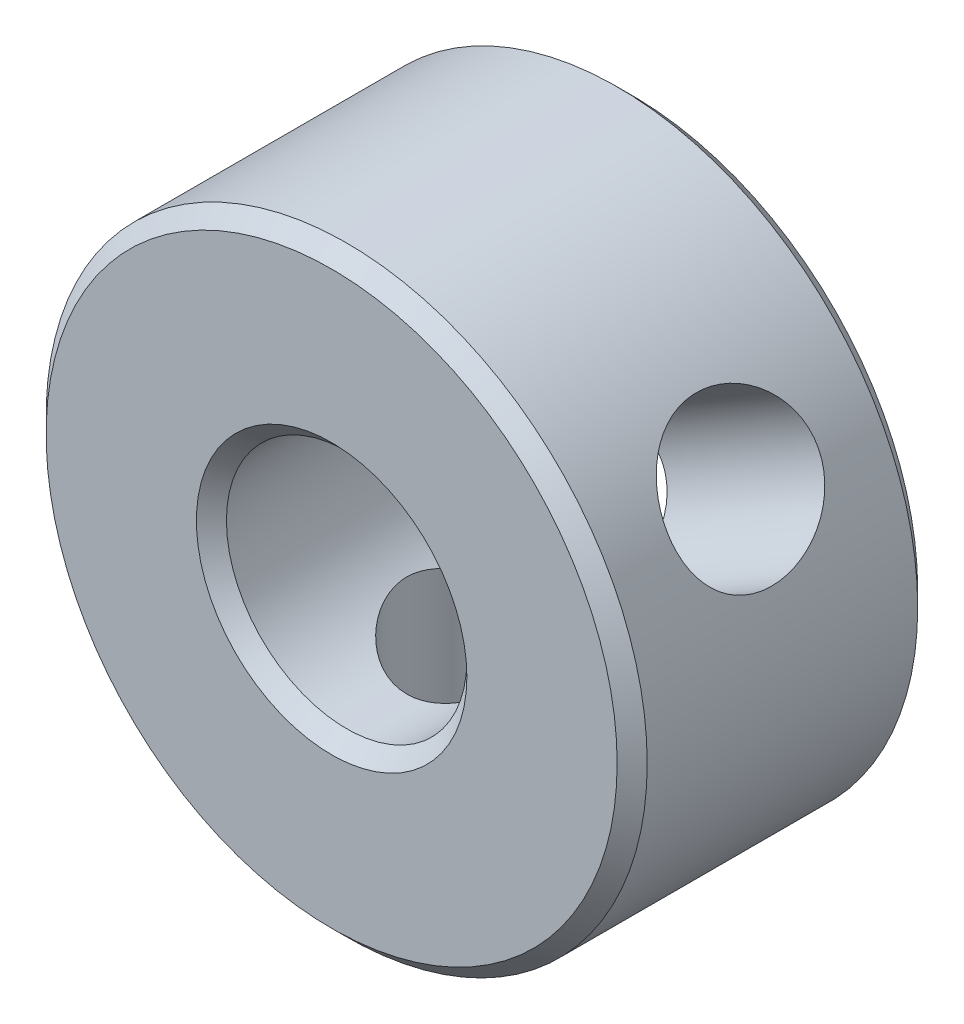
ISO-10303-21;
HEADER;
FILE_DESCRIPTION(('STEP AP214'),'2;1');
FILE_NAME('part.step','',(''),(''),'','','');
FILE_SCHEMA(('AUTOMOTIVE_DESIGN { 1 0 10303 214 1 1 1 1 }'));
ENDSEC;
DATA;
#1=APPLICATION_CONTEXT('core data for automotive mechanical design processes');
#2=APPLICATION_PROTOCOL_DEFINITION('international standard','automotive_design',2000,#1);
#3=PRODUCT_CONTEXT('',#1,'mechanical');
#4=PRODUCT('Part','Part','',(#3));
#5=PRODUCT_RELATED_PRODUCT_CATEGORY('part','',(#4));
#6=PRODUCT_DEFINITION_FORMATION('','',#4);
#7=PRODUCT_DEFINITION_CONTEXT('part definition',#1,'design');
#8=PRODUCT_DEFINITION('design','',#6,#7);
#9=PRODUCT_DEFINITION_SHAPE('','',#8);
#10=(LENGTH_UNIT() NAMED_UNIT(*) SI_UNIT(.MILLI.,.METRE.));
#11=(NAMED_UNIT(*) PLANE_ANGLE_UNIT() SI_UNIT($,.RADIAN.));
#12=(NAMED_UNIT(*) SI_UNIT($,.STERADIAN.) SOLID_ANGLE_UNIT());
#13=UNCERTAINTY_MEASURE_WITH_UNIT(LENGTH_MEASURE(1.E-05),#10,'distance_accuracy_value','');
#14=(GEOMETRIC_REPRESENTATION_CONTEXT(3) GLOBAL_UNCERTAINTY_ASSIGNED_CONTEXT((#13)) GLOBAL_UNIT_ASSIGNED_CONTEXT((#10,
#11,#12)) REPRESENTATION_CONTEXT('',''));
#15=CARTESIAN_POINT('',(0.,0.,0.));
#16=DIRECTION('',(0.,0.,1.));
#17=DIRECTION('',(1.,0.,0.));
#18=AXIS2_PLACEMENT_3D('',#15,#16,#17);
#19=CARTESIAN_POINT('',(0.,0.,-10.));
#20=DIRECTION('',(0.,0.,1.));
#21=DIRECTION('',(1.,0.,0.));
#22=AXIS2_PLACEMENT_3D('',#19,#20,#21);
#23=CYLINDRICAL_SURFACE('',#22,10.);
#24=CARTESIAN_POINT('',(9.6352549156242,2.67616567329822,-5.));
#25=CARTESIAN_POINT('',(9.63525523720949,2.67617038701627,-5.13805075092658));
#26=CARTESIAN_POINT('',(9.63210285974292,2.68759458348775,-5.27614489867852));
#27=CARTESIAN_POINT('',(9.61937602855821,2.73278922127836,-5.54836757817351));
#28=CARTESIAN_POINT('',(9.60979783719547,2.76657266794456,-5.68249375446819));
#29=CARTESIAN_POINT('',(9.58391006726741,2.85495532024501,-5.94280353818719));
#30=CARTESIAN_POINT('',(9.56760917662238,2.90952765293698,-6.06899715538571));
#31=CARTESIAN_POINT('',(9.5278131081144,3.03730745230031,-6.31031085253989));
#32=CARTESIAN_POINT('',(9.5043176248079,3.11051571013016,-6.42543046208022));
#33=CARTESIAN_POINT('',(9.44907629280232,3.27453410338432,-6.64386164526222));
#34=CARTESIAN_POINT('',(9.4171759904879,3.36566467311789,-6.74689360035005));
#35=CARTESIAN_POINT('',(9.34490436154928,3.56140836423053,-6.93576139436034));
#36=CARTESIAN_POINT('',(9.30453224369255,3.66602274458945,-7.02159562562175));
#37=CARTESIAN_POINT('',(9.21449269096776,3.88683880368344,-7.17477546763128));
#38=CARTESIAN_POINT('',(9.16470341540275,4.00318179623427,-7.24184638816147));
#39=CARTESIAN_POINT('',(9.05647555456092,4.24234044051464,-7.35380964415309));
#40=CARTESIAN_POINT('',(8.9980382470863,4.36515513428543,-7.39870525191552));
#41=CARTESIAN_POINT('',(8.87468040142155,4.61069782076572,-7.46414783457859));
#42=CARTESIAN_POINT('',(8.80991518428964,4.73337716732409,-7.48516964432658));
#43=CARTESIAN_POINT('',(8.67447899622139,4.97723353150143,-7.50375837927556));
#44=CARTESIAN_POINT('',(8.60380889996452,5.09841076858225,-7.5013287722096));
#45=CARTESIAN_POINT('',(8.46033146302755,5.33303795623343,-7.47342514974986));
#46=CARTESIAN_POINT('',(8.38760634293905,5.44659970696,-7.44846367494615));
#47=CARTESIAN_POINT('',(8.24102110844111,5.66594946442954,-7.3770287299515));
#48=CARTESIAN_POINT('',(8.16716093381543,5.77173705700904,-7.33055411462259));
#49=CARTESIAN_POINT('',(8.02036378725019,5.9740726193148,-7.21699742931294));
#50=CARTESIAN_POINT('',(7.94744118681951,6.07052846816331,-7.14973295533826));
#51=CARTESIAN_POINT('',(7.80609517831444,6.25124461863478,-6.99664432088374));
#52=CARTESIAN_POINT('',(7.73767255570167,6.33550279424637,-6.91081693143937));
#53=CARTESIAN_POINT('',(7.60646202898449,6.49249557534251,-6.72029125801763));
#54=CARTESIAN_POINT('',(7.54387674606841,6.56485658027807,-6.61514510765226));
#55=CARTESIAN_POINT('',(7.42950428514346,6.69402197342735,-6.39040002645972));
#56=CARTESIAN_POINT('',(7.37771761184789,6.75082563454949,-6.2708004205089));
#57=CARTESIAN_POINT('',(7.28744965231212,6.84817688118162,-6.01970996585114));
#58=CARTESIAN_POINT('',(7.24903410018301,6.88864430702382,-5.8881642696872));
#59=CARTESIAN_POINT('',(7.1881168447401,6.9521892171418,-5.61741453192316));
#60=CARTESIAN_POINT('',(7.16561173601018,6.97527042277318,-5.4782121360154));
#61=CARTESIAN_POINT('',(7.13828856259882,7.00322865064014,-5.20004049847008));
#62=CARTESIAN_POINT('',(7.1330190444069,7.00857038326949,-5.06116220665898));
#63=CARTESIAN_POINT('',(7.13922190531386,7.00225180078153,-4.78417806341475));
#64=CARTESIAN_POINT('',(7.15069274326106,6.99059305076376,-4.64607214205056));
#65=CARTESIAN_POINT('',(7.18934405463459,6.95083246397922,-4.37688573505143));
#66=CARTESIAN_POINT('',(7.21626442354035,6.92300278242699,-4.2457272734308));
#67=CARTESIAN_POINT('',(7.28408845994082,6.85160306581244,-3.99156854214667));
#68=CARTESIAN_POINT('',(7.32499378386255,6.80803116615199,-3.86856924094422));
#69=CARTESIAN_POINT('',(7.41957761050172,6.70483734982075,-3.6315587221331));
#70=CARTESIAN_POINT('',(7.47349094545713,6.64491734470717,-3.51777115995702));
#71=CARTESIAN_POINT('',(7.59098627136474,6.51036775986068,-3.30481163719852));
#72=CARTESIAN_POINT('',(7.65456985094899,6.43573576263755,-3.20564208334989));
#73=CARTESIAN_POINT('',(7.79021214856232,6.27090481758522,-3.02218895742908));
#74=CARTESIAN_POINT('',(7.86244311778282,6.1803630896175,-2.9383399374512));
#75=CARTESIAN_POINT('',(8.01084582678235,5.98675234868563,-2.79106413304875));
#76=CARTESIAN_POINT('',(8.0870173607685,5.88368398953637,-2.72763628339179));
#77=CARTESIAN_POINT('',(8.23956671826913,5.66805412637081,-2.62355396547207));
#78=CARTESIAN_POINT('',(8.31593892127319,5.55556787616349,-2.58273571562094));
#79=CARTESIAN_POINT('',(8.46649332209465,5.32330927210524,-2.52453966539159));
#80=CARTESIAN_POINT('',(8.54067593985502,5.20353832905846,-2.50715734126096));
#81=CARTESIAN_POINT('',(8.68234823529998,4.96344019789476,-2.49658102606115));
#82=CARTESIAN_POINT('',(8.74996464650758,4.84321561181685,-2.50274572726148));
#83=CARTESIAN_POINT('',(8.87886382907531,4.60265155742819,-2.53761956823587));
#84=CARTESIAN_POINT('',(8.94014678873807,4.48231209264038,-2.56632803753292));
#85=CARTESIAN_POINT('',(9.05484155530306,4.24582601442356,-2.64513054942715));
#86=CARTESIAN_POINT('',(9.10829395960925,4.12966031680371,-2.69510863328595));
#87=CARTESIAN_POINT('',(9.20712587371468,3.90435464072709,-2.81492644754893));
#88=CARTESIAN_POINT('',(9.25250436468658,3.79521555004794,-2.88476868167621));
#89=CARTESIAN_POINT('',(9.33607529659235,3.58480572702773,-3.04428808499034));
#90=CARTESIAN_POINT('',(9.37406953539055,3.48378613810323,-3.13440035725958));
#91=CARTESIAN_POINT('',(9.4417659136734,3.29591417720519,-3.33105712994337));
#92=CARTESIAN_POINT('',(9.47146594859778,3.20906540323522,-3.43760579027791));
#93=CARTESIAN_POINT('',(9.52353066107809,3.05113481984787,-3.66650353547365));
#94=CARTESIAN_POINT('',(9.54574815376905,2.98037738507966,-3.78911030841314));
#95=CARTESIAN_POINT('',(9.58262240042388,2.85960890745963,-4.04513872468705));
#96=CARTESIAN_POINT('',(9.59728465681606,2.80958277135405,-4.17855241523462));
#97=CARTESIAN_POINT('',(9.61743337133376,2.73971219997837,-4.4264425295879));
#98=CARTESIAN_POINT('',(9.62413024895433,2.71595058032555,-4.53973291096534));
#99=CARTESIAN_POINT('',(9.63304069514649,2.68417601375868,-4.76867217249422));
#100=CARTESIAN_POINT('',(9.63525464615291,2.67616172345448,-4.88432085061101));
#101=CARTESIAN_POINT('',(9.6352549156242,2.67616567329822,-5.));
#102=B_SPLINE_CURVE_WITH_KNOTS('',3,(#24,#25,#26,#27,#28,#29,#30,#31,#32,#33,#34,#35,#36,#37,
#38,#39,#40,#41,#42,#43,#44,#45,#46,#47,#48,#49,#50,#51,#52,#53,#54,#55,#56,#57,#58,#59,#60,#61,
#62,#63,#64,#65,#66,#67,#68,#69,#70,#71,#72,#73,#74,#75,#76,#77,#78,#79,#80,#81,#82,#83,#84,#85,
#86,#87,#88,#89,#90,#91,#92,#93,#94,#95,#96,#97,#98,#99,#100,#101),.UNSPECIFIED.,.T.,.F.,(4,2,2,
2,2,2,2,2,2,2,2,2,2,2,2,2,2,2,2,2,2,2,2,2,2,2,2,2,2,2,2,2,2,2,2,2,2,2,4),(0.,0.413727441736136,
0.827695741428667,1.24113072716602,1.65458326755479,2.07623954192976,2.49793521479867,
2.9255149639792,3.35303159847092,3.77188750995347,4.19068148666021,4.60018262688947,
5.00970556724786,5.42292874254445,5.83622385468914,6.26070466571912,6.68520531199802,
7.11176432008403,7.53823200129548,7.95343574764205,8.36860127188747,8.77697405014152,
9.18539521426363,9.60182845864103,10.0183301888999,10.4452533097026,10.872154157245,
11.2959207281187,11.7196054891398,12.131834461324,12.5440511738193,12.9540487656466,
13.3640980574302,13.7839709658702,14.2039503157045,14.6317647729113,15.0592672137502,
15.4059782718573,15.7526597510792),.UNSPECIFIED.);
#103=CARTESIAN_POINT('',(9.6352549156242,2.67616567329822,-5.));
#104=VERTEX_POINT('',#103);
#105=EDGE_CURVE('E63',#104,#104,#102,.T.);
#106=ORIENTED_EDGE('',*,*,#105,.F.);
#107=EDGE_LOOP('',(#106));
#108=FACE_BOUND('',#107,.T.);
#109=CARTESIAN_POINT('',(0.,-10.,-2.5));
#110=CARTESIAN_POINT('',(-0.138126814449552,-9.99999766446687,-2.50000387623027));
#111=CARTESIAN_POINT('',(-0.276296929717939,-9.99710963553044,-2.51148591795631));
#112=CARTESIAN_POINT('',(-0.548677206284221,-9.98586856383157,-2.55704191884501));
#113=CARTESIAN_POINT('',(-0.682885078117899,-9.97751242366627,-2.59112868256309));
#114=CARTESIAN_POINT('',(-0.943368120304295,-9.9562604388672,-2.68073208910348));
#115=CARTESIAN_POINT('',(-1.06965260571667,-9.94337004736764,-2.73622299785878));
#116=CARTESIAN_POINT('',(-1.31112021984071,-9.91442239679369,-2.86696898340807));
#117=CARTESIAN_POINT('',(-1.42630297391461,-9.89836503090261,-2.94222472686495));
#118=CARTESIAN_POINT('',(-1.64466987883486,-9.86445689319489,-3.1120013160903));
#119=CARTESIAN_POINT('',(-1.74759281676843,-9.84657845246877,-3.20685262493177));
#120=CARTESIAN_POINT('',(-1.93624821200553,-9.8112270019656,-3.41242034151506));
#121=CARTESIAN_POINT('',(-2.02197872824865,-9.79375403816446,-3.5231385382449));
#122=CARTESIAN_POINT('',(-2.17504423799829,-9.76091292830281,-3.75932537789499));
#123=CARTESIAN_POINT('',(-2.2420870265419,-9.74557990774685,-3.88498871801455));
#124=CARTESIAN_POINT('',(-2.35399484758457,-9.71915824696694,-4.14624735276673));
#125=CARTESIAN_POINT('',(-2.39886342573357,-9.70806892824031,-4.28184105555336));
#126=CARTESIAN_POINT('',(-2.46425806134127,-9.69167461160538,-4.55623916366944));
#127=CARTESIAN_POINT('',(-2.48525378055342,-9.68625818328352,-4.69492482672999));
#128=CARTESIAN_POINT('',(-2.50376962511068,-9.68148937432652,-4.97394761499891));
#129=CARTESIAN_POINT('',(-2.50129356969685,-9.68213600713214,-5.11428446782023));
#130=CARTESIAN_POINT('',(-2.47331087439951,-9.68932009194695,-5.38902634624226));
#131=CARTESIAN_POINT('',(-2.44836390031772,-9.69571438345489,-5.52349270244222));
#132=CARTESIAN_POINT('',(-2.37704031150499,-9.71344516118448,-5.7862684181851));
#133=CARTESIAN_POINT('',(-2.33066217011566,-9.72478199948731,-5.91457733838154));
#134=CARTESIAN_POINT('',(-2.21731579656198,-9.75125189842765,-6.16289669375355));
#135=CARTESIAN_POINT('',(-2.1501444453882,-9.76642212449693,-6.28281028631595));
#136=CARTESIAN_POINT('',(-1.99726046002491,-9.79882851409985,-6.50986451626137));
#137=CARTESIAN_POINT('',(-1.91154458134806,-9.81606503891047,-6.61700291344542));
#138=CARTESIAN_POINT('',(-1.72110570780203,-9.85126467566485,-6.81867269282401));
#139=CARTESIAN_POINT('',(-1.61591043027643,-9.86923449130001,-6.91275748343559));
#140=CARTESIAN_POINT('',(-1.39101986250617,-9.90343275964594,-7.08203540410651));
#141=CARTESIAN_POINT('',(-1.27132412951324,-9.91966115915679,-7.15722795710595));
#142=CARTESIAN_POINT('',(-1.02019314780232,-9.94862886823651,-7.28675097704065));
#143=CARTESIAN_POINT('',(-0.88871898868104,-9.96135600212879,-7.34100890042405));
#144=CARTESIAN_POINT('',(-0.618126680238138,-9.98179861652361,-7.42652884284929));
#145=CARTESIAN_POINT('',(-0.479009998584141,-9.98951505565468,-7.4577952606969));
#146=CARTESIAN_POINT('',(-0.200899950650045,-9.99892498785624,-7.49576260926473));
#147=CARTESIAN_POINT('',(-0.0619945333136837,-10.0007675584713,-7.50307171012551));
#148=CARTESIAN_POINT('',(0.215054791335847,-9.99864674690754,-7.49458499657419));
#149=CARTESIAN_POINT('',(0.353198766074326,-9.99468388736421,-7.47879126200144));
#150=CARTESIAN_POINT('',(0.622690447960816,-9.98149301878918,-7.42504848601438));
#151=CARTESIAN_POINT('',(0.754108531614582,-9.97234390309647,-7.38743122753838));
#152=CARTESIAN_POINT('',(1.00876215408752,-9.94981177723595,-7.2914881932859));
#153=CARTESIAN_POINT('',(1.13199686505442,-9.93642833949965,-7.23316032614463));
#154=CARTESIAN_POINT('',(1.36920522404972,-9.9065551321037,-7.09627311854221));
#155=CARTESIAN_POINT('',(1.48297573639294,-9.89001445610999,-7.01737314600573));
#156=CARTESIAN_POINT('',(1.69587768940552,-9.85574181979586,-6.84201681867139));
#157=CARTESIAN_POINT('',(1.79500659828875,-9.83800965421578,-6.74555743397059));
#158=CARTESIAN_POINT('',(1.97831761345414,-9.80281594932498,-6.53499673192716));
#159=CARTESIAN_POINT('',(2.06207311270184,-9.78537173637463,-6.42052049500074));
#160=CARTESIAN_POINT('',(2.20918459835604,-9.75321463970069,-6.17877894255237));
#161=CARTESIAN_POINT('',(2.27254149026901,-9.73850163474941,-6.05151419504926));
#162=CARTESIAN_POINT('',(2.37658570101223,-9.71363491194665,-5.78849046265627));
#163=CARTESIAN_POINT('',(2.41740732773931,-9.70345425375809,-5.65278728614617));
#164=CARTESIAN_POINT('',(2.47557609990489,-9.68877906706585,-5.37615060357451));
#165=CARTESIAN_POINT('',(2.49292837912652,-9.68428329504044,-5.23521824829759));
#166=CARTESIAN_POINT('',(2.50339765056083,-9.68158168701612,-4.95646496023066));
#167=CARTESIAN_POINT('',(2.49719649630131,-9.68319887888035,-4.81867094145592));
#168=CARTESIAN_POINT('',(2.46229546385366,-9.69213181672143,-4.54616018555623));
#169=CARTESIAN_POINT('',(2.43359603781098,-9.69944744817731,-4.41144338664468));
#170=CARTESIAN_POINT('',(2.35488553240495,-9.71885434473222,-4.14965256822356));
#171=CARTESIAN_POINT('',(2.30500234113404,-9.73091692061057,-4.02253782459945));
#172=CARTESIAN_POINT('',(2.18544152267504,-9.7584625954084,-3.77839102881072));
#173=CARTESIAN_POINT('',(2.11576115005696,-9.77394616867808,-3.66136037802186));
#174=CARTESIAN_POINT('',(1.95644624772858,-9.80709390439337,-3.43740895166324));
#175=CARTESIAN_POINT('',(1.86633860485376,-9.82480441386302,-3.33083154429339));
#176=CARTESIAN_POINT('',(1.66964895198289,-9.86013378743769,-3.13408825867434));
#177=CARTESIAN_POINT('',(1.56306303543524,-9.87775262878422,-3.04392628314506));
#178=CARTESIAN_POINT('',(1.33411264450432,-9.9112942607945,-2.88098115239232));
#179=CARTESIAN_POINT('',(1.21149737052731,-9.92718055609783,-2.80854231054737));
#180=CARTESIAN_POINT('',(0.95544343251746,-9.95508208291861,-2.68542089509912));
#181=CARTESIAN_POINT('',(0.822012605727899,-9.96710008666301,-2.63472273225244));
#182=CARTESIAN_POINT('',(0.57401708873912,-9.98413432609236,-2.56404694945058));
#183=CARTESIAN_POINT('',(0.460633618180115,-9.99004308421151,-2.54008126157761));
#184=CARTESIAN_POINT('',(0.231510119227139,-9.9979767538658,-2.5080567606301));
#185=CARTESIAN_POINT('',(0.115770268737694,-10.0000019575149,-2.49999675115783));
#186=CARTESIAN_POINT('',(0.,-10.,-2.5));
#187=B_SPLINE_CURVE_WITH_KNOTS('',3,(#109,#110,#111,#112,#113,#114,#115,#116,#117,#118,#119,
#120,#121,#122,#123,#124,#125,#126,#127,#128,#129,#130,#131,#132,#133,#134,#135,#136,#137,#138,
#139,#140,#141,#142,#143,#144,#145,#146,#147,#148,#149,#150,#151,#152,#153,#154,#155,#156,#157,
#158,#159,#160,#161,#162,#163,#164,#165,#166,#167,#168,#169,#170,#171,#172,#173,#174,#175,#176,
#177,#178,#179,#180,#181,#182,#183,#184,#185,#186),.UNSPECIFIED.,.T.,.F.,(4,2,2,2,2,2,2,2,2,2,2,
2,2,2,2,2,2,2,2,2,2,2,2,2,2,2,2,2,2,2,2,2,2,2,2,2,2,2,4),(0.,0.41395618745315,0.828147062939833,
1.24184150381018,1.65554990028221,2.07690725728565,2.4983121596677,2.92597745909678,
3.35357435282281,3.77260491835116,4.19156730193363,4.60037495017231,5.00921172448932,
5.42217546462,5.83521151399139,6.26002501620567,6.6848514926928,7.11113715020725,
7.53734122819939,7.95263848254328,8.36789835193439,8.7770045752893,9.18615212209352,
9.60255979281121,10.0190393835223,10.4457418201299,10.8724253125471,11.2965375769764,
11.7205570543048,12.1323963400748,12.5442273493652,12.9536066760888,13.3630428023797,
13.7831596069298,14.2033761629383,14.6312030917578,15.0587227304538,15.4057040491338,
15.752659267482),.UNSPECIFIED.);
#188=CARTESIAN_POINT('',(0.,-10.,-2.5));
#189=VERTEX_POINT('',#188);
#190=EDGE_CURVE('E62',#189,#189,#187,.T.);
#191=ORIENTED_EDGE('',*,*,#190,.F.);
#192=EDGE_LOOP('',(#191));
#193=FACE_BOUND('',#192,.T.);
#194=CARTESIAN_POINT('',(0.,0.,-0.5));
#195=DIRECTION('',(0.,0.,1.));
#196=DIRECTION('',(1.,0.,0.));
#197=AXIS2_PLACEMENT_3D('',#194,#195,#196);
#198=CIRCLE('',#197,10.);
#199=CARTESIAN_POINT('',(10.,0.,-0.5));
#200=VERTEX_POINT('',#199);
#201=EDGE_CURVE('E116',#200,#200,#198,.F.);
#202=ORIENTED_EDGE('',*,*,#201,.T.);
#203=EDGE_LOOP('',(#202));
#204=FACE_BOUND('',#203,.T.);
#205=CARTESIAN_POINT('',(0.,0.,-9.5));
#206=DIRECTION('',(0.,0.,1.));
#207=DIRECTION('',(1.,0.,0.));
#208=AXIS2_PLACEMENT_3D('',#205,#206,#207);
#209=CIRCLE('',#208,10.);
#210=CARTESIAN_POINT('',(10.,0.,-9.5));
#211=VERTEX_POINT('',#210);
#212=EDGE_CURVE('E118',#211,#211,#209,.T.);
#213=ORIENTED_EDGE('',*,*,#212,.T.);
#214=EDGE_LOOP('',(#213));
#215=FACE_BOUND('',#214,.T.);
#216=ADVANCED_FACE('F31',(#108,#193,#204,#215),#23,.T.);
#217=CARTESIAN_POINT('',(0.,0.,-10.));
#218=DIRECTION('',(0.,0.,1.));
#219=DIRECTION('',(1.,0.,0.));
#220=AXIS2_PLACEMENT_3D('',#217,#218,#219);
#221=PLANE('',#220);
#222=CARTESIAN_POINT('',(0.,0.,-10.));
#223=DIRECTION('',(0.,0.,1.));
#224=DIRECTION('',(1.,0.,0.));
#225=AXIS2_PLACEMENT_3D('',#222,#223,#224);
#226=CIRCLE('',#225,4.5);
#227=CARTESIAN_POINT('',(4.5,0.,-10.));
#228=VERTEX_POINT('',#227);
#229=EDGE_CURVE('E52',#228,#228,#226,.T.);
#230=ORIENTED_EDGE('',*,*,#229,.T.);
#231=EDGE_LOOP('',(#230));
#232=FACE_BOUND('',#231,.T.);
#233=CARTESIAN_POINT('',(0.,0.,-10.));
#234=DIRECTION('',(0.,0.,1.));
#235=DIRECTION('',(1.,0.,0.));
#236=AXIS2_PLACEMENT_3D('',#233,#234,#235);
#237=CIRCLE('',#236,9.5);
#238=CARTESIAN_POINT('',(9.5,0.,-10.));
#239=VERTEX_POINT('',#238);
#240=EDGE_CURVE('E55',#239,#239,#237,.F.);
#241=ORIENTED_EDGE('',*,*,#240,.T.);
#242=EDGE_LOOP('',(#241));
#243=FACE_BOUND('',#242,.T.);
#244=ADVANCED_FACE('F92',(#232,#243),#221,.F.);
#245=CARTESIAN_POINT('',(0.,0.,0.));
#246=DIRECTION('',(0.,0.,1.));
#247=DIRECTION('',(1.,0.,0.));
#248=AXIS2_PLACEMENT_3D('',#245,#246,#247);
#249=PLANE('',#248);
#250=CARTESIAN_POINT('',(0.,0.,0.));
#251=DIRECTION('',(0.,0.,1.));
#252=DIRECTION('',(1.,0.,0.));
#253=AXIS2_PLACEMENT_3D('',#250,#251,#252);
#254=CIRCLE('',#253,4.5);
#255=CARTESIAN_POINT('',(4.5,0.,0.));
#256=VERTEX_POINT('',#255);
#257=EDGE_CURVE('E10',#256,#256,#254,.F.);
#258=ORIENTED_EDGE('',*,*,#257,.T.);
#259=EDGE_LOOP('',(#258));
#260=FACE_BOUND('',#259,.T.);
#261=CARTESIAN_POINT('',(0.,0.,0.));
#262=DIRECTION('',(0.,0.,1.));
#263=DIRECTION('',(1.,0.,0.));
#264=AXIS2_PLACEMENT_3D('',#261,#262,#263);
#265=CIRCLE('',#264,9.5);
#266=CARTESIAN_POINT('',(9.5,0.,0.));
#267=VERTEX_POINT('',#266);
#268=EDGE_CURVE('E84',#267,#267,#265,.T.);
#269=ORIENTED_EDGE('',*,*,#268,.T.);
#270=EDGE_LOOP('',(#269));
#271=FACE_BOUND('',#270,.T.);
#272=ADVANCED_FACE('F94',(#260,#271),#249,.T.);
#273=CARTESIAN_POINT('',(0.,0.,-10.));
#274=DIRECTION('',(0.,0.,1.));
#275=DIRECTION('',(1.,0.,0.));
#276=AXIS2_PLACEMENT_3D('',#273,#274,#275);
#277=CYLINDRICAL_SURFACE('',#276,4.);
#278=CARTESIAN_POINT('',(4.,0.,-6.49999999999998));
#279=CARTESIAN_POINT('',(3.9999969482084,0.0987788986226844,-6.61406170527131));
#280=CARTESIAN_POINT('',(3.99632017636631,0.206437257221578,-6.72052845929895));
#281=CARTESIAN_POINT('',(3.97786278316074,0.435751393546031,-6.91659296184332));
#282=CARTESIAN_POINT('',(3.96305623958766,0.557439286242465,-7.00615071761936));
#283=CARTESIAN_POINT('',(3.91895755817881,0.811450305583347,-7.16603627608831));
#284=CARTESIAN_POINT('',(3.88959514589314,0.943822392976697,-7.23626819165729));
#285=CARTESIAN_POINT('',(3.81395521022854,1.21379485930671,-7.35359275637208));
#286=CARTESIAN_POINT('',(3.76770815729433,1.35138542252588,-7.40072673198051));
#287=CARTESIAN_POINT('',(3.66352948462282,1.61120760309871,-7.46526784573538));
#288=CARTESIAN_POINT('',(3.60739408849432,1.7334965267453,-7.4853310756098));
#289=CARTESIAN_POINT('',(3.4821851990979,1.97296614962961,-7.50344059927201));
#290=CARTESIAN_POINT('',(3.41311860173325,2.09014953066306,-7.50149859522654));
#291=CARTESIAN_POINT('',(3.27291668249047,2.30270164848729,-7.47719736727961));
#292=CARTESIAN_POINT('',(3.20285057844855,2.39905069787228,-7.45711471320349));
#293=CARTESIAN_POINT('',(3.05709279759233,2.5822251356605,-7.4006920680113));
#294=CARTESIAN_POINT('',(2.98140044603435,2.6690493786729,-7.36435012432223));
#295=CARTESIAN_POINT('',(2.82438197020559,2.83484989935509,-7.27536092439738));
#296=CARTESIAN_POINT('',(2.74295123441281,2.91343794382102,-7.22218042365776));
#297=CARTESIAN_POINT('',(2.57992924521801,3.0587428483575,-7.10179772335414));
#298=CARTESIAN_POINT('',(2.49833794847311,3.12545586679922,-7.03459100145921));
#299=CARTESIAN_POINT('',(2.3266997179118,3.25570405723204,-6.87756512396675));
#300=CARTESIAN_POINT('',(2.23703857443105,3.3175319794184,-6.78590567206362));
#301=CARTESIAN_POINT('',(2.06516568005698,3.42717250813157,-6.58811617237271));
#302=CARTESIAN_POINT('',(1.9829664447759,3.47496185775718,-6.48196253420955));
#303=CARTESIAN_POINT('',(1.82253960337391,3.56195555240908,-6.24427953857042));
#304=CARTESIAN_POINT('',(1.7456826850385,3.59969012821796,-6.11124976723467));
#305=CARTESIAN_POINT('',(1.64753666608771,3.6451246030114,-5.90158132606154));
#306=CARTESIAN_POINT('',(1.6176913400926,3.65840332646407,-5.8300529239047));
#307=CARTESIAN_POINT('',(1.56469353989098,3.68138049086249,-5.68402200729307));
#308=CARTESIAN_POINT('',(1.54153757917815,3.6910807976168,-5.6095210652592));
#309=CARTESIAN_POINT('',(1.49465901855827,3.71037902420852,-5.42576700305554));
#310=CARTESIAN_POINT('',(1.47491733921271,3.71816419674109,-5.31525969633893));
#311=CARTESIAN_POINT('',(1.4532360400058,3.72669428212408,-5.0923238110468));
#312=CARTESIAN_POINT('',(1.45128029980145,3.72744557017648,-4.97989706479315));
#313=CARTESIAN_POINT('',(1.46534347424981,3.72193734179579,-4.75643263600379));
#314=CARTESIAN_POINT('',(1.48135272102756,3.71568159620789,-4.64539423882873));
#315=CARTESIAN_POINT('',(1.52959153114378,3.69608031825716,-4.42753310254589));
#316=CARTESIAN_POINT('',(1.56183611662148,3.68272821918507,-4.32071436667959));
#317=CARTESIAN_POINT('',(1.64133328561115,3.64800897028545,-4.10899144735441));
#318=CARTESIAN_POINT('',(1.68916217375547,3.62632714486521,-4.00435863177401));
#319=CARTESIAN_POINT('',(1.79594275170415,3.57464804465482,-3.80318038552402));
#320=CARTESIAN_POINT('',(1.85489927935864,3.54464715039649,-3.70663849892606));
#321=CARTESIAN_POINT('',(1.99432678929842,3.46846086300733,-3.50283460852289));
#322=CARTESIAN_POINT('',(2.07670790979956,3.42019154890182,-3.39764914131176));
#323=CARTESIAN_POINT('',(2.24885090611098,3.30955889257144,-3.2015907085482));
#324=CARTESIAN_POINT('',(2.3386201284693,3.24718141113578,-3.11073225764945));
#325=CARTESIAN_POINT('',(2.53145361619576,3.09966993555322,-2.93611309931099));
#326=CARTESIAN_POINT('',(2.63490308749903,3.01280040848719,-2.85419435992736));
#327=CARTESIAN_POINT('',(2.78864824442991,2.86852202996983,-2.74879495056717));
#328=CARTESIAN_POINT('',(2.83967005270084,2.81808698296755,-2.71656951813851));
#329=CARTESIAN_POINT('',(2.94053489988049,2.71266619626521,-2.65836260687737));
#330=CARTESIAN_POINT('',(2.99037873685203,2.65768365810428,-2.63237678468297));
#331=CARTESIAN_POINT('',(3.08299753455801,2.54944243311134,-2.5894561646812));
#332=CARTESIAN_POINT('',(3.12596465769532,2.49661048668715,-2.57185693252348));
#333=CARTESIAN_POINT('',(3.20980961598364,2.387851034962,-2.54226829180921));
#334=CARTESIAN_POINT('',(3.2506886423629,2.33192533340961,-2.53027565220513));
#335=CARTESIAN_POINT('',(3.32985934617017,2.21740298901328,-2.51209669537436));
#336=CARTESIAN_POINT('',(3.36815247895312,2.1588078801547,-2.50590708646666));
#337=CARTESIAN_POINT('',(3.44172777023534,2.03946926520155,-2.49942606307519));
#338=CARTESIAN_POINT('',(3.47701025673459,1.97872599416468,-2.49913400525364));
#339=CARTESIAN_POINT('',(3.56891485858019,1.81040797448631,-2.50643854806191));
#340=CARTESIAN_POINT('',(3.62219098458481,1.70118559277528,-2.51998294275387));
#341=CARTESIAN_POINT('',(3.71749803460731,1.48141791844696,-2.56419748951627));
#342=CARTESIAN_POINT('',(3.75952803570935,1.37087251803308,-2.59486904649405));
#343=CARTESIAN_POINT('',(3.83262262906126,1.15088260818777,-2.67217159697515));
#344=CARTESIAN_POINT('',(3.86361080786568,1.04145067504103,-2.71890956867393));
#345=CARTESIAN_POINT('',(3.91507272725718,0.827260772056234,-2.8265866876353));
#346=CARTESIAN_POINT('',(3.9355439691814,0.722503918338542,-2.88752920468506));
#347=CARTESIAN_POINT('',(3.96939942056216,0.507144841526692,-3.03053620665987));
#348=CARTESIAN_POINT('',(3.98156034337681,0.397478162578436,-3.11429702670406));
#349=CARTESIAN_POINT('',(3.99685563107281,0.189785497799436,-3.29609778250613));
#350=CARTESIAN_POINT('',(3.99997647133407,0.0917771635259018,-3.3941588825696));
#351=CARTESIAN_POINT('',(4.00002619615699,-0.1011062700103,-3.61659796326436));
#352=CARTESIAN_POINT('',(3.99610961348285,-0.193967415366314,-3.74273817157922));
#353=CARTESIAN_POINT('',(3.98500719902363,-0.35537245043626,-4.00956110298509));
#354=CARTESIAN_POINT('',(3.9778278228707,-0.423963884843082,-4.15021468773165));
#355=CARTESIAN_POINT('',(3.96674693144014,-0.5162111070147,-4.40374091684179));
#356=CARTESIAN_POINT('',(3.96248199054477,-0.546974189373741,-4.51400805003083));
#357=CARTESIAN_POINT('',(3.95636375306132,-0.589635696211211,-4.73814327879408));
#358=CARTESIAN_POINT('',(3.95450709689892,-0.60156040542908,-4.8520061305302));
#359=CARTESIAN_POINT('',(3.95390842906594,-0.605487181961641,-5.08029257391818));
#360=CARTESIAN_POINT('',(3.95517205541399,-0.597453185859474,-5.19471680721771));
#361=CARTESIAN_POINT('',(3.96033984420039,-0.562146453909,-5.42056279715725));
#362=CARTESIAN_POINT('',(3.96424709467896,-0.534851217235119,-5.53198088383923));
#363=CARTESIAN_POINT('',(3.97320770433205,-0.463553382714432,-5.7480675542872));
#364=CARTESIAN_POINT('',(3.97825050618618,-0.41970231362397,-5.85278756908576));
#365=CARTESIAN_POINT('',(3.98767396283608,-0.317893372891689,-6.05496768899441));
#366=CARTESIAN_POINT('',(3.99205519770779,-0.259947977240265,-6.15243411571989));
#367=CARTESIAN_POINT('',(3.99815363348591,-0.135746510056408,-6.33425981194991));
#368=CARTESIAN_POINT('',(4.00000216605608,-0.0701098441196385,-6.41904294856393));
#369=CARTESIAN_POINT('',(4.,0.,-6.49999999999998));
#370=B_SPLINE_CURVE_WITH_KNOTS('',3,(#278,#279,#280,#281,#282,#283,#284,#285,#286,#287,#288,
#289,#290,#291,#292,#293,#294,#295,#296,#297,#298,#299,#300,#301,#302,#303,#304,#305,#306,#307,
#308,#309,#310,#311,#312,#313,#314,#315,#316,#317,#318,#319,#320,#321,#322,#323,#324,#325,#326,
#327,#328,#329,#330,#331,#332,#333,#334,#335,#336,#337,#338,#339,#340,#341,#342,#343,#344,#345,
#346,#347,#348,#349,#350,#351,#352,#353,#354,#355,#356,#357,#358,#359,#360,#361,#362,#363,#364,
#365,#366,#367,#368,#369),.UNSPECIFIED.,.T.,.F.,(4,2,2,2,2,2,2,2,2,2,2,2,2,2,2,2,2,2,2,2,2,2,2,
2,2,2,2,2,2,2,2,2,2,2,2,2,2,2,2,2,2,2,2,2,2,4),(0.,0.452316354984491,0.905689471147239,
1.36127306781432,1.81603853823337,2.22179714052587,2.62733997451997,2.98813346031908,
3.34897028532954,3.72262222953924,4.09639483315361,4.52171730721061,4.94774046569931,
5.41943939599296,5.65499144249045,5.89042049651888,6.22638844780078,6.56205186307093,
6.8975347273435,7.23332857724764,7.58330357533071,7.93343108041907,8.35790395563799,
8.78280413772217,9.2538417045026,9.48946915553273,9.7249321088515,9.93563403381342,
10.1462143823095,10.3566752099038,10.567113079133,10.9320166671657,11.2969501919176,
11.6643622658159,12.0318615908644,12.4458253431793,12.8604080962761,13.3281621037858,
13.7949946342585,14.137222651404,14.4789727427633,14.8213407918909,15.1641094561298,
15.5038140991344,15.8432191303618,16.1642576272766),.UNSPECIFIED.);
#371=CARTESIAN_POINT('',(4.,0.,-6.49999999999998));
#372=VERTEX_POINT('',#371);
#373=EDGE_CURVE('E35',#372,#372,#370,.T.);
#374=ORIENTED_EDGE('',*,*,#373,.T.);
#375=EDGE_LOOP('',(#374));
#376=FACE_BOUND('',#375,.T.);
#377=CARTESIAN_POINT('',(0.,0.,-9.49999999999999));
#378=DIRECTION('',(0.,0.,1.));
#379=DIRECTION('',(1.,0.,0.));
#380=AXIS2_PLACEMENT_3D('',#377,#378,#379);
#381=CIRCLE('',#380,4.);
#382=CARTESIAN_POINT('',(4.,0.,-9.49999999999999));
#383=VERTEX_POINT('',#382);
#384=EDGE_CURVE('E43',#383,#383,#381,.F.);
#385=ORIENTED_EDGE('',*,*,#384,.T.);
#386=EDGE_LOOP('',(#385));
#387=FACE_BOUND('',#386,.T.);
#388=CARTESIAN_POINT('',(0.,0.,-0.499999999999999));
#389=DIRECTION('',(0.,0.,1.));
#390=DIRECTION('',(1.,0.,0.));
#391=AXIS2_PLACEMENT_3D('',#388,#389,#390);
#392=CIRCLE('',#391,4.);
#393=CARTESIAN_POINT('',(4.,0.,-0.499999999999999));
#394=VERTEX_POINT('',#393);
#395=EDGE_CURVE('E47',#394,#394,#392,.T.);
#396=ORIENTED_EDGE('',*,*,#395,.T.);
#397=EDGE_LOOP('',(#396));
#398=FACE_BOUND('',#397,.T.);
#399=CARTESIAN_POINT('',(0.,-4.,-2.5));
#400=CARTESIAN_POINT('',(-0.127017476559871,-3.99999041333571,-2.50001047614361));
#401=CARTESIAN_POINT('',(-0.254191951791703,-3.9938860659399,-2.50974649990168));
#402=CARTESIAN_POINT('',(-0.504637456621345,-3.97004375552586,-2.54817112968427));
#403=CARTESIAN_POINT('',(-0.627900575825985,-3.95228361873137,-2.57689586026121));
#404=CARTESIAN_POINT('',(-0.866410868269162,-3.90691695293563,-2.65162285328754));
#405=CARTESIAN_POINT('',(-0.98169442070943,-3.87935918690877,-2.69753960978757));
#406=CARTESIAN_POINT('',(-1.20252080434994,-3.81669199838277,-2.80477166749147));
#407=CARTESIAN_POINT('',(-1.30806471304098,-3.7815834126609,-2.86608526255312));
#408=CARTESIAN_POINT('',(-1.51594836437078,-3.70340304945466,-3.0077731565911));
#409=CARTESIAN_POINT('',(-1.61735911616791,-3.65991924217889,-3.08927860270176));
#410=CARTESIAN_POINT('',(-1.80597275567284,-3.57062700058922,-3.26643834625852));
#411=CARTESIAN_POINT('',(-1.89315621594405,-3.52481549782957,-3.36211165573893));
#412=CARTESIAN_POINT('',(-2.06285746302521,-3.42860837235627,-3.58006778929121));
#413=CARTESIAN_POINT('',(-2.14314412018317,-3.37843221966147,-3.70419957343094));
#414=CARTESIAN_POINT('',(-2.28147932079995,-3.28660396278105,-3.96712963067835));
#415=CARTESIAN_POINT('',(-2.33956541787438,-3.2449375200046,-4.10590262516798));
#416=CARTESIAN_POINT('',(-2.41866801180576,-3.18619151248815,-4.35762104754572));
#417=CARTESIAN_POINT('',(-2.44539104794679,-3.16553811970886,-4.46793363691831));
#418=CARTESIAN_POINT('',(-2.4836368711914,-3.1356271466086,-4.69261185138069));
#419=CARTESIAN_POINT('',(-2.49518112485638,-3.12635347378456,-4.80697151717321));
#420=CARTESIAN_POINT('',(-2.50237836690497,-3.12059771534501,-5.03682603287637));
#421=CARTESIAN_POINT('',(-2.49798968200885,-3.12414917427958,-5.15232307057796));
#422=CARTESIAN_POINT('',(-2.47352633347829,-3.14354804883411,-5.38062020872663));
#423=CARTESIAN_POINT('',(-2.45343909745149,-3.15940531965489,-5.49341807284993));
#424=CARTESIAN_POINT('',(-2.3993620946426,-3.20065145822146,-5.71087689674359));
#425=CARTESIAN_POINT('',(-2.36570043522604,-3.22581428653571,-5.81566487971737));
#426=CARTESIAN_POINT('',(-2.28580369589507,-3.28291134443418,-6.01832239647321));
#427=CARTESIAN_POINT('',(-2.2395641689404,-3.31484796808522,-6.11618946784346));
#428=CARTESIAN_POINT('',(-2.12589830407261,-3.38909625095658,-6.32166640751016));
#429=CARTESIAN_POINT('',(-2.05612773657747,-3.4322315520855,-6.42768105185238));
#430=CARTESIAN_POINT('',(-1.90176111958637,-3.52011451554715,-6.6276611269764));
#431=CARTESIAN_POINT('',(-1.81714983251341,-3.56486379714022,-6.72161400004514));
#432=CARTESIAN_POINT('',(-1.61904732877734,-3.65959667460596,-6.91060100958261));
#433=CARTESIAN_POINT('',(-1.50309447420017,-3.70922571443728,-7.0032559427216));
#434=CARTESIAN_POINT('',(-1.25426444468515,-3.8005660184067,-7.16771179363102));
#435=CARTESIAN_POINT('',(-1.12139395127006,-3.84228039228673,-7.23952090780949));
#436=CARTESIAN_POINT('',(-0.915775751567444,-3.89435975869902,-7.32734595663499));
#437=CARTESIAN_POINT('',(-0.848193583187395,-3.90966874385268,-7.3528342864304));
#438=CARTESIAN_POINT('',(-0.710492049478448,-3.93701839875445,-7.39800765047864));
#439=CARTESIAN_POINT('',(-0.640374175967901,-3.94906095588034,-7.41769603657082));
#440=CARTESIAN_POINT('',(-0.498239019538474,-3.96949699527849,-7.45093416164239));
#441=CARTESIAN_POINT('',(-0.426223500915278,-3.97789374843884,-7.464489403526));
#442=CARTESIAN_POINT('',(-0.280965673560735,-3.99078766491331,-7.48524629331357));
#443=CARTESIAN_POINT('',(-0.207723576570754,-3.99528549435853,-7.49244902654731));
#444=CARTESIAN_POINT('',(-0.00911917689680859,-4.00193773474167,-7.50310930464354));
#445=CARTESIAN_POINT('',(0.116782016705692,-4.000238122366,-7.50040036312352));
#446=CARTESIAN_POINT('',(0.365967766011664,-3.98518313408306,-7.47624033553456));
#447=CARTESIAN_POINT('',(0.489252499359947,-3.97182855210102,-7.45479052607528));
#448=CARTESIAN_POINT('',(0.725036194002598,-3.93547975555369,-7.39552141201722));
#449=CARTESIAN_POINT('',(0.83776842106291,-3.91288306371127,-7.35837527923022));
#450=CARTESIAN_POINT('',(1.05527816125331,-3.85991402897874,-7.26940762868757));
#451=CARTESIAN_POINT('',(1.16005433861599,-3.82954038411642,-7.21758365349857));
#452=CARTESIAN_POINT('',(1.37016761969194,-3.75980014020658,-7.09496946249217));
#453=CARTESIAN_POINT('',(1.47449380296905,-3.71983526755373,-7.02279282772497));
#454=CARTESIAN_POINT('',(1.67028541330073,-3.63613942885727,-6.86441230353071));
#455=CARTESIAN_POINT('',(1.76173634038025,-3.59240430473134,-6.77819283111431));
#456=CARTESIAN_POINT('',(1.94294835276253,-3.49811738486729,-6.57972991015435));
#457=CARTESIAN_POINT('',(2.03053702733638,-3.44749766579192,-6.46552558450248));
#458=CARTESIAN_POINT('',(2.18560704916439,-3.35133525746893,-6.22224843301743));
#459=CARTESIAN_POINT('',(2.25310231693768,-3.30578906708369,-6.09318598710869));
#460=CARTESIAN_POINT('',(2.35369543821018,-3.23467060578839,-5.85061570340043));
#461=CARTESIAN_POINT('',(2.39103791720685,-3.20691272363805,-5.7395184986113));
#462=CARTESIAN_POINT('',(2.45000216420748,-3.16210061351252,-5.51121370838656));
#463=CARTESIAN_POINT('',(2.47164849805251,-3.1450296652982,-5.39401598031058));
#464=CARTESIAN_POINT('',(2.49802767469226,-3.124126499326,-5.15581944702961));
#465=CARTESIAN_POINT('',(2.50266374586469,-3.12037003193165,-5.03480283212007));
#466=CARTESIAN_POINT('',(2.49439556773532,-3.12698126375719,-4.79373807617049));
#467=CARTESIAN_POINT('',(2.48148548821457,-3.13735365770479,-4.67369027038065));
#468=CARTESIAN_POINT('',(2.44076547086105,-3.16910777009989,-4.4479404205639));
#469=CARTESIAN_POINT('',(2.41423847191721,-3.18953614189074,-4.34186143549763));
#470=CARTESIAN_POINT('',(2.34835238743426,-3.23835062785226,-4.13572984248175));
#471=CARTESIAN_POINT('',(2.30898795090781,-3.26674005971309,-4.03567976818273));
#472=CARTESIAN_POINT('',(2.21205415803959,-3.33327797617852,-3.82880667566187));
#473=CARTESIAN_POINT('',(2.15267427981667,-3.3722442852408,-3.72310005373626));
#474=CARTESIAN_POINT('',(2.01999894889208,-3.45335445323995,-3.52212261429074));
#475=CARTESIAN_POINT('',(1.94669224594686,-3.49550086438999,-3.42686033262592));
#476=CARTESIAN_POINT('',(1.77134669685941,-3.58803675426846,-3.22997441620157));
#477=CARTESIAN_POINT('',(1.66649284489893,-3.63840488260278,-3.13083023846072));
#478=CARTESIAN_POINT('',(1.43961937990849,-3.7339805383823,-2.95099840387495));
#479=CARTESIAN_POINT('',(1.3175892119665,-3.77918486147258,-2.87032217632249));
#480=CARTESIAN_POINT('',(1.12346357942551,-3.83959214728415,-2.76543656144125));
#481=CARTESIAN_POINT('',(1.05679601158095,-3.85851834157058,-2.73312519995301));
#482=CARTESIAN_POINT('',(0.920199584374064,-3.89335165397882,-2.67432774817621));
#483=CARTESIAN_POINT('',(0.850272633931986,-3.9092605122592,-2.6478382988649));
#484=CARTESIAN_POINT('',(0.707873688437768,-3.93753374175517,-2.60114285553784));
#485=CARTESIAN_POINT('',(0.635409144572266,-3.94990764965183,-2.58091994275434));
#486=CARTESIAN_POINT('',(0.488456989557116,-3.97075677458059,-2.54702454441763));
#487=CARTESIAN_POINT('',(0.413970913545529,-3.97923486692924,-2.53334722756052));
#488=CARTESIAN_POINT('',(0.28285260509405,-3.99038271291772,-2.51540958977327));
#489=CARTESIAN_POINT('',(0.226501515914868,-3.99398159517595,-2.50963846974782));
#490=CARTESIAN_POINT('',(0.113444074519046,-3.99879245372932,-2.50193121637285));
#491=CARTESIAN_POINT('',(0.0567377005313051,-4.00000428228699,-2.49999532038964));
#492=CARTESIAN_POINT('',(0.,-4.,-2.5));
#493=B_SPLINE_CURVE_WITH_KNOTS('',3,(#399,#400,#401,#402,#403,#404,#405,#406,#407,#408,#409,
#410,#411,#412,#413,#414,#415,#416,#417,#418,#419,#420,#421,#422,#423,#424,#425,#426,#427,#428,
#429,#430,#431,#432,#433,#434,#435,#436,#437,#438,#439,#440,#441,#442,#443,#444,#445,#446,#447,
#448,#449,#450,#451,#452,#453,#454,#455,#456,#457,#458,#459,#460,#461,#462,#463,#464,#465,#466,
#467,#468,#469,#470,#471,#472,#473,#474,#475,#476,#477,#478,#479,#480,#481,#482,#483,#484,#485,
#486,#487,#488,#489,#490,#491,#492),.UNSPECIFIED.,.T.,.F.,(4,2,2,2,2,2,2,2,2,2,2,2,2,2,2,2,2,2,
2,2,2,2,2,2,2,2,2,2,2,2,2,2,2,2,2,2,2,2,2,2,2,2,2,2,2,2,4),(0.,0.380824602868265,
0.762375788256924,1.14205397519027,1.52169010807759,1.93164374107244,2.34215256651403,
2.80825951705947,3.27357449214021,3.61824017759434,3.96241789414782,4.30749646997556,
4.65285169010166,4.99031678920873,5.32790135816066,5.72854900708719,6.12961045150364,
6.59684361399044,7.06389281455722,7.28510978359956,7.50619865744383,7.72708876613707,
7.94794112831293,8.32363778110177,8.69930884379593,9.06028425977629,9.42132014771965,
9.81879878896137,10.216721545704,10.6724083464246,11.1277787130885,11.4876929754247,
11.8470427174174,12.2084336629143,12.5699447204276,12.9023575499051,13.2349091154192,
13.6156046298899,13.9966089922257,14.4531049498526,14.9098826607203,15.1389848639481,
15.3679545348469,15.5963005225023,15.8244777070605,15.994578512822,16.1646898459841),.UNSPECIFIED.);
#494=CARTESIAN_POINT('',(0.,-4.,-2.5));
#495=VERTEX_POINT('',#494);
#496=EDGE_CURVE('E56',#495,#495,#493,.T.);
#497=ORIENTED_EDGE('',*,*,#496,.T.);
#498=EDGE_LOOP('',(#497));
#499=FACE_BOUND('',#498,.T.);
#500=ADVANCED_FACE('F65',(#376,#387,#398,#499),#277,.F.);
#501=CARTESIAN_POINT('',(0.,0.,0.));
#502=DIRECTION('',(0.,0.,-1.));
#503=DIRECTION('',(-1.,0.,0.));
#504=AXIS2_PLACEMENT_3D('',#501,#502,#503);
#505=CONICAL_SURFACE('',#504,9.5,0.785398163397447);
#506=ORIENTED_EDGE('',*,*,#201,.F.);
#507=EDGE_LOOP('',(#506));
#508=FACE_BOUND('',#507,.T.);
#509=ORIENTED_EDGE('',*,*,#268,.F.);
#510=EDGE_LOOP('',(#509));
#511=FACE_BOUND('',#510,.T.);
#512=ADVANCED_FACE('F95',(#508,#511),#505,.T.);
#513=CARTESIAN_POINT('',(0.,0.,-9.5));
#514=DIRECTION('',(0.,0.,1.));
#515=DIRECTION('',(1.,0.,0.));
#516=AXIS2_PLACEMENT_3D('',#513,#514,#515);
#517=CONICAL_SURFACE('',#516,10.,0.785398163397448);
#518=ORIENTED_EDGE('',*,*,#240,.F.);
#519=EDGE_LOOP('',(#518));
#520=FACE_BOUND('',#519,.T.);
#521=ORIENTED_EDGE('',*,*,#212,.F.);
#522=EDGE_LOOP('',(#521));
#523=FACE_BOUND('',#522,.T.);
#524=ADVANCED_FACE('F72',(#520,#523),#517,.T.);
#525=CARTESIAN_POINT('',(0.,-10.,-5.));
#526=DIRECTION('',(0.,1.,0.));
#527=DIRECTION('',(0.,0.,1.));
#528=AXIS2_PLACEMENT_3D('',#525,#526,#527);
#529=CYLINDRICAL_SURFACE('',#528,2.5);
#530=ORIENTED_EDGE('',*,*,#190,.T.);
#531=EDGE_LOOP('',(#530));
#532=FACE_BOUND('',#531,.T.);
#533=ORIENTED_EDGE('',*,*,#496,.F.);
#534=EDGE_LOOP('',(#533));
#535=FACE_BOUND('',#534,.T.);
#536=ADVANCED_FACE('F68',(#532,#535),#529,.F.);
#537=CARTESIAN_POINT('',(0.,0.,-10.));
#538=DIRECTION('',(0.,0.,-1.));
#539=DIRECTION('',(-1.,0.,0.));
#540=AXIS2_PLACEMENT_3D('',#537,#538,#539);
#541=CONICAL_SURFACE('',#540,4.5,0.785398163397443);
#542=ORIENTED_EDGE('',*,*,#384,.F.);
#543=EDGE_LOOP('',(#542));
#544=FACE_BOUND('',#543,.T.);
#545=ORIENTED_EDGE('',*,*,#229,.F.);
#546=EDGE_LOOP('',(#545));
#547=FACE_BOUND('',#546,.T.);
#548=ADVANCED_FACE('F71',(#544,#547),#541,.F.);
#549=CARTESIAN_POINT('',(0.,0.,-0.499999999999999));
#550=DIRECTION('',(0.,0.,1.));
#551=DIRECTION('',(1.,0.,0.));
#552=AXIS2_PLACEMENT_3D('',#549,#550,#551);
#553=CONICAL_SURFACE('',#552,4.,0.785398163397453);
#554=ORIENTED_EDGE('',*,*,#257,.F.);
#555=EDGE_LOOP('',(#554));
#556=FACE_BOUND('',#555,.T.);
#557=ORIENTED_EDGE('',*,*,#395,.F.);
#558=EDGE_LOOP('',(#557));
#559=FACE_BOUND('',#558,.T.);
#560=ADVANCED_FACE('F33',(#556,#559),#553,.F.);
#561=CARTESIAN_POINT('',(11.8301270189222,6.83012701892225,-5.));
#562=DIRECTION('',(-0.866025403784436,-0.500000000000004,0.));
#563=DIRECTION('',(0.500000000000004,-0.866025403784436,0.));
#564=AXIS2_PLACEMENT_3D('',#561,#562,#563);
#565=CYLINDRICAL_SURFACE('',#564,2.5);
#566=ORIENTED_EDGE('',*,*,#105,.T.);
#567=EDGE_LOOP('',(#566));
#568=FACE_BOUND('',#567,.T.);
#569=ORIENTED_EDGE('',*,*,#373,.F.);
#570=EDGE_LOOP('',(#569));
#571=FACE_BOUND('',#570,.T.);
#572=ADVANCED_FACE('F74',(#568,#571),#565,.F.);
#573=CLOSED_SHELL('',(#216,#244,#272,#500,#512,#524,#536,#548,#560,#572));
#574=MANIFOLD_SOLID_BREP('B2',#573);
#575=ADVANCED_BREP_SHAPE_REPRESENTATION('',(#18,#574),#14);
#576=SHAPE_DEFINITION_REPRESENTATION(#9,#575);
ENDSEC;
END-ISO-10303-21;
